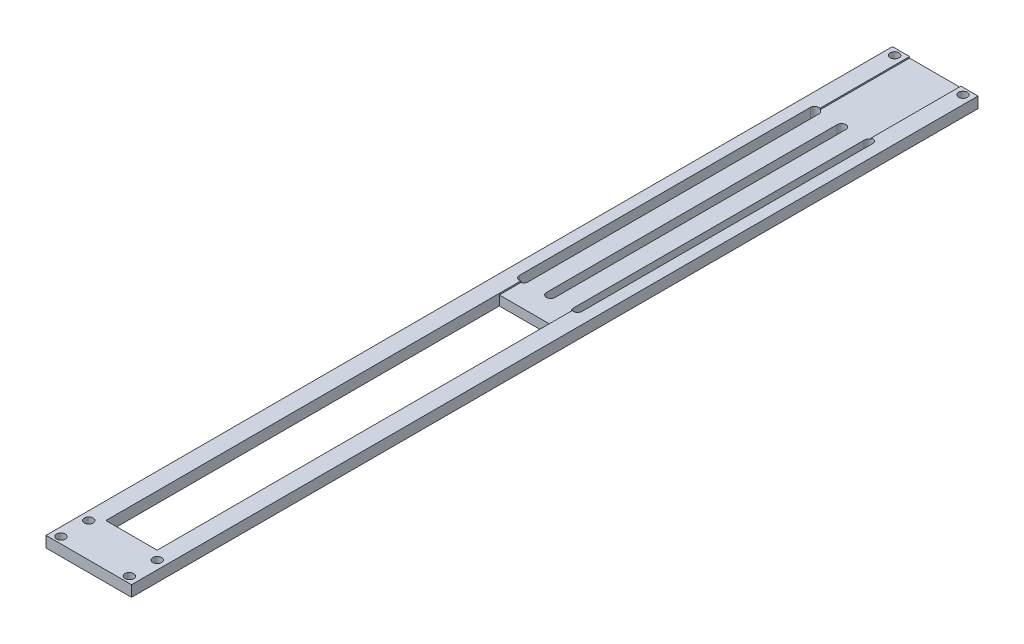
ISO-10303-21;
HEADER;
FILE_DESCRIPTION(('STEP AP214'),'2;1');
FILE_NAME('part.step','',(''),(''),'','','');
FILE_SCHEMA(('AUTOMOTIVE_DESIGN { 1 0 10303 214 1 1 1 1 }'));
ENDSEC;
DATA;
#1=APPLICATION_CONTEXT('core data for automotive mechanical design processes');
#2=APPLICATION_PROTOCOL_DEFINITION('international standard','automotive_design',2000,#1);
#3=PRODUCT_CONTEXT('',#1,'mechanical');
#4=PRODUCT('Part','Part','',(#3));
#5=PRODUCT_RELATED_PRODUCT_CATEGORY('part','',(#4));
#6=PRODUCT_DEFINITION_FORMATION('','',#4);
#7=PRODUCT_DEFINITION_CONTEXT('part definition',#1,'design');
#8=PRODUCT_DEFINITION('design','',#6,#7);
#9=PRODUCT_DEFINITION_SHAPE('','',#8);
#10=(LENGTH_UNIT() NAMED_UNIT(*) SI_UNIT(.MILLI.,.METRE.));
#11=(NAMED_UNIT(*) PLANE_ANGLE_UNIT() SI_UNIT($,.RADIAN.));
#12=(NAMED_UNIT(*) SI_UNIT($,.STERADIAN.) SOLID_ANGLE_UNIT());
#13=UNCERTAINTY_MEASURE_WITH_UNIT(LENGTH_MEASURE(1.E-05),#10,'distance_accuracy_value','');
#14=(GEOMETRIC_REPRESENTATION_CONTEXT(3) GLOBAL_UNCERTAINTY_ASSIGNED_CONTEXT((#13)) GLOBAL_UNIT_ASSIGNED_CONTEXT((#10,
#11,#12)) REPRESENTATION_CONTEXT('',''));
#15=CARTESIAN_POINT('',(0.,0.,0.));
#16=DIRECTION('',(0.,0.,1.));
#17=DIRECTION('',(1.,0.,0.));
#18=AXIS2_PLACEMENT_3D('',#15,#16,#17);
#19=CARTESIAN_POINT('',(9.525,-4.318,152.273));
#20=DIRECTION('',(1.,0.,0.));
#21=DIRECTION('',(0.,0.,-1.));
#22=AXIS2_PLACEMENT_3D('',#19,#20,#21);
#23=PLANE('',#22);
#24=DIRECTION('',(0.,0.,-1.));
#25=VECTOR('',#24,1.);
#26=CARTESIAN_POINT('',(9.525,2.032,152.273));
#27=LINE('',#26,#25);
#28=CARTESIAN_POINT('',(9.52500000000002,2.032,298.323));
#29=VERTEX_POINT('',#28);
#30=CARTESIAN_POINT('',(9.525,2.032,144.27128620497));
#31=VERTEX_POINT('',#30);
#32=EDGE_CURVE('E342',#29,#31,#27,.T.);
#33=ORIENTED_EDGE('',*,*,#32,.T.);
#34=DIRECTION('',(0.,-1.,0.));
#35=VECTOR('',#34,1.);
#36=CARTESIAN_POINT('',(9.525,6.096,144.27128620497));
#37=LINE('',#36,#35);
#38=CARTESIAN_POINT('',(9.525,1.524,144.27128620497));
#39=VERTEX_POINT('',#38);
#40=EDGE_CURVE('E243',#31,#39,#37,.T.);
#41=ORIENTED_EDGE('',*,*,#40,.T.);
#42=DIRECTION('',(0.,0.,-1.));
#43=VECTOR('',#42,1.);
#44=CARTESIAN_POINT('',(9.525,1.524,152.273));
#45=LINE('',#44,#43);
#46=CARTESIAN_POINT('',(9.525,1.524,152.273));
#47=VERTEX_POINT('',#46);
#48=EDGE_CURVE('E322',#47,#39,#45,.T.);
#49=ORIENTED_EDGE('',*,*,#48,.F.);
#50=DIRECTION('',(0.,1.,0.));
#51=VECTOR('',#50,1.);
#52=CARTESIAN_POINT('',(9.525,-4.318,152.273));
#53=LINE('',#52,#51);
#54=CARTESIAN_POINT('',(9.525,-2.032,152.273));
#55=VERTEX_POINT('',#54);
#56=EDGE_CURVE('E350',#55,#47,#53,.T.);
#57=ORIENTED_EDGE('',*,*,#56,.F.);
#58=DIRECTION('',(0.,0.,-1.));
#59=VECTOR('',#58,1.);
#60=CARTESIAN_POINT('',(9.52500000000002,-2.032,314.198));
#61=LINE('',#60,#59);
#62=CARTESIAN_POINT('',(9.52500000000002,-2.032,298.323));
#63=VERTEX_POINT('',#62);
#64=EDGE_CURVE('E391',#63,#55,#61,.T.);
#65=ORIENTED_EDGE('',*,*,#64,.F.);
#66=DIRECTION('',(0.,1.,0.));
#67=VECTOR('',#66,1.);
#68=CARTESIAN_POINT('',(9.52500000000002,-4.318,298.323));
#69=LINE('',#68,#67);
#70=EDGE_CURVE('E353',#63,#29,#69,.T.);
#71=ORIENTED_EDGE('',*,*,#70,.T.);
#72=EDGE_LOOP('',(#33,#41,#49,#57,#65,#71));
#73=FACE_BOUND('',#72,.T.);
#74=ADVANCED_FACE('F35',(#73),#23,.F.);
#75=CARTESIAN_POINT('',(-9.525,-4.318,152.273));
#76=DIRECTION('',(-1.,0.,0.));
#77=DIRECTION('',(0.,0.,1.));
#78=AXIS2_PLACEMENT_3D('',#75,#76,#77);
#79=PLANE('',#78);
#80=DIRECTION('',(0.,0.,1.));
#81=VECTOR('',#80,1.);
#82=CARTESIAN_POINT('',(-9.525,1.524,152.273));
#83=LINE('',#82,#81);
#84=CARTESIAN_POINT('',(-9.525,1.524,144.280295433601));
#85=VERTEX_POINT('',#84);
#86=CARTESIAN_POINT('',(-9.525,1.524,152.273));
#87=VERTEX_POINT('',#86);
#88=EDGE_CURVE('E319',#85,#87,#83,.T.);
#89=ORIENTED_EDGE('',*,*,#88,.F.);
#90=DIRECTION('',(0.,-1.,0.));
#91=VECTOR('',#90,1.);
#92=CARTESIAN_POINT('',(-9.525,6.096,144.280295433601));
#93=LINE('',#92,#91);
#94=CARTESIAN_POINT('',(-9.525,2.032,144.280295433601));
#95=VERTEX_POINT('',#94);
#96=EDGE_CURVE('E278',#85,#95,#93,.F.);
#97=ORIENTED_EDGE('',*,*,#96,.T.);
#98=DIRECTION('',(0.,0.,1.));
#99=VECTOR('',#98,1.);
#100=CARTESIAN_POINT('',(-9.525,2.032,152.273));
#101=LINE('',#100,#99);
#102=CARTESIAN_POINT('',(-9.52499999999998,2.032,298.323));
#103=VERTEX_POINT('',#102);
#104=EDGE_CURVE('E334',#95,#103,#101,.T.);
#105=ORIENTED_EDGE('',*,*,#104,.T.);
#106=DIRECTION('',(0.,1.,0.));
#107=VECTOR('',#106,1.);
#108=CARTESIAN_POINT('',(-9.52499999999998,-4.318,298.323));
#109=LINE('',#108,#107);
#110=CARTESIAN_POINT('',(-9.52499999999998,-2.032,298.323));
#111=VERTEX_POINT('',#110);
#112=EDGE_CURVE('E345',#111,#103,#109,.T.);
#113=ORIENTED_EDGE('',*,*,#112,.F.);
#114=DIRECTION('',(0.,0.,1.));
#115=VECTOR('',#114,1.);
#116=CARTESIAN_POINT('',(-9.52499999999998,-2.032,314.198));
#117=LINE('',#116,#115);
#118=CARTESIAN_POINT('',(-9.525,-2.032,152.273));
#119=VERTEX_POINT('',#118);
#120=EDGE_CURVE('E397',#119,#111,#117,.T.);
#121=ORIENTED_EDGE('',*,*,#120,.F.);
#122=DIRECTION('',(0.,1.,0.));
#123=VECTOR('',#122,1.);
#124=CARTESIAN_POINT('',(-9.525,-4.318,152.273));
#125=LINE('',#124,#123);
#126=EDGE_CURVE('E346',#119,#87,#125,.T.);
#127=ORIENTED_EDGE('',*,*,#126,.T.);
#128=EDGE_LOOP('',(#89,#97,#105,#113,#121,#127));
#129=FACE_BOUND('',#128,.T.);
#130=ADVANCED_FACE('F523',(#129),#79,.F.);
#131=CARTESIAN_POINT('',(15.875,2.032,314.198));
#132=DIRECTION('',(-1.,0.,0.));
#133=DIRECTION('',(0.,0.,1.));
#134=AXIS2_PLACEMENT_3D('',#131,#132,#133);
#135=PLANE('',#134);
#136=DIRECTION('',(0.,1.,0.));
#137=VECTOR('',#136,1.);
#138=CARTESIAN_POINT('',(15.875,2.032,0.));
#139=LINE('',#138,#137);
#140=CARTESIAN_POINT('',(15.875,-2.032,0.));
#141=VERTEX_POINT('',#140);
#142=CARTESIAN_POINT('',(15.875,2.032,0.));
#143=VERTEX_POINT('',#142);
#144=EDGE_CURVE('E349',#141,#143,#139,.T.);
#145=ORIENTED_EDGE('',*,*,#144,.T.);
#146=DIRECTION('',(0.,0.,-1.));
#147=VECTOR('',#146,1.);
#148=CARTESIAN_POINT('',(15.875,2.032,314.198));
#149=LINE('',#148,#147);
#150=CARTESIAN_POINT('',(15.875,2.032,314.198));
#151=VERTEX_POINT('',#150);
#152=EDGE_CURVE('E385',#151,#143,#149,.T.);
#153=ORIENTED_EDGE('',*,*,#152,.F.);
#154=DIRECTION('',(0.,1.,0.));
#155=VECTOR('',#154,1.);
#156=CARTESIAN_POINT('',(15.875,2.032,314.198));
#157=LINE('',#156,#155);
#158=CARTESIAN_POINT('',(15.875,-2.032,314.198));
#159=VERTEX_POINT('',#158);
#160=EDGE_CURVE('E357',#159,#151,#157,.T.);
#161=ORIENTED_EDGE('',*,*,#160,.F.);
#162=DIRECTION('',(0.,0.,-1.));
#163=VECTOR('',#162,1.);
#164=CARTESIAN_POINT('',(15.875,-2.032,314.198));
#165=LINE('',#164,#163);
#166=EDGE_CURVE('E367',#159,#141,#165,.T.);
#167=ORIENTED_EDGE('',*,*,#166,.T.);
#168=EDGE_LOOP('',(#145,#153,#161,#167));
#169=FACE_BOUND('',#168,.T.);
#170=ADVANCED_FACE('F37',(#169),#135,.F.);
#171=CARTESIAN_POINT('',(-15.875,2.032,314.198));
#172=DIRECTION('',(0.,-1.,0.));
#173=DIRECTION('',(0.,0.,-1.));
#174=AXIS2_PLACEMENT_3D('',#171,#172,#173);
#175=PLANE('',#174);
#176=CARTESIAN_POINT('',(12.7,2.032,311.81675));
#177=DIRECTION('',(0.,1.,0.));
#178=DIRECTION('',(0.,0.,1.));
#179=AXIS2_PLACEMENT_3D('',#176,#177,#178);
#180=CIRCLE('',#179,1.63195);
#181=CARTESIAN_POINT('',(12.7,2.032,313.4487));
#182=VERTEX_POINT('',#181);
#183=EDGE_CURVE('E447',#182,#182,#180,.T.);
#184=ORIENTED_EDGE('',*,*,#183,.F.);
#185=EDGE_LOOP('',(#184));
#186=FACE_BOUND('',#185,.T.);
#187=CARTESIAN_POINT('',(-12.7,2.032,311.81675));
#188=DIRECTION('',(0.,1.,0.));
#189=DIRECTION('',(0.,0.,1.));
#190=AXIS2_PLACEMENT_3D('',#187,#188,#189);
#191=CIRCLE('',#190,1.63195);
#192=CARTESIAN_POINT('',(-12.7,2.032,313.4487));
#193=VERTEX_POINT('',#192);
#194=EDGE_CURVE('E437',#193,#193,#191,.T.);
#195=ORIENTED_EDGE('',*,*,#194,.F.);
#196=EDGE_LOOP('',(#195));
#197=FACE_BOUND('',#196,.T.);
#198=CARTESIAN_POINT('',(12.7,2.032,2.38125));
#199=DIRECTION('',(0.,1.,0.));
#200=DIRECTION('',(0.,0.,1.));
#201=AXIS2_PLACEMENT_3D('',#198,#199,#200);
#202=CIRCLE('',#201,1.63195);
#203=CARTESIAN_POINT('',(12.7,2.032,4.0132));
#204=VERTEX_POINT('',#203);
#205=EDGE_CURVE('E434',#204,#204,#202,.T.);
#206=ORIENTED_EDGE('',*,*,#205,.F.);
#207=EDGE_LOOP('',(#206));
#208=FACE_BOUND('',#207,.T.);
#209=CARTESIAN_POINT('',(-12.7,2.032,2.38125));
#210=DIRECTION('',(0.,1.,0.));
#211=DIRECTION('',(0.,0.,1.));
#212=AXIS2_PLACEMENT_3D('',#209,#210,#211);
#213=CIRCLE('',#212,1.63195);
#214=CARTESIAN_POINT('',(-12.7,2.032,4.0132));
#215=VERTEX_POINT('',#214);
#216=EDGE_CURVE('E431',#215,#215,#213,.T.);
#217=ORIENTED_EDGE('',*,*,#216,.F.);
#218=EDGE_LOOP('',(#217));
#219=FACE_BOUND('',#218,.T.);
#220=DIRECTION('',(0.,0.,1.));
#221=VECTOR('',#220,1.);
#222=CARTESIAN_POINT('',(11.6144886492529,2.032,314.198));
#223=LINE('',#222,#221);
#224=CARTESIAN_POINT('',(11.6144886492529,2.032,34.798));
#225=VERTEX_POINT('',#224);
#226=CARTESIAN_POINT('',(11.6144886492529,2.032,142.748));
#227=VERTEX_POINT('',#226);
#228=EDGE_CURVE('E249',#225,#227,#223,.T.);
#229=ORIENTED_EDGE('',*,*,#228,.T.);
#230=CARTESIAN_POINT('',(10.0144886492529,2.032,142.748));
#231=DIRECTION('',(0.,-1.,0.));
#232=DIRECTION('',(0.,0.,-1.));
#233=AXIS2_PLACEMENT_3D('',#230,#231,#232);
#234=CIRCLE('',#233,1.6);
#235=EDGE_CURVE('E246',#227,#31,#234,.T.);
#236=ORIENTED_EDGE('',*,*,#235,.T.);
#237=ORIENTED_EDGE('',*,*,#32,.F.);
#238=DIRECTION('',(1.,0.,0.));
#239=VECTOR('',#238,1.);
#240=CARTESIAN_POINT('',(-9.52499999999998,2.032,298.323));
#241=LINE('',#240,#239);
#242=EDGE_CURVE('E338',#103,#29,#241,.T.);
#243=ORIENTED_EDGE('',*,*,#242,.F.);
#244=ORIENTED_EDGE('',*,*,#104,.F.);
#245=CARTESIAN_POINT('',(-9.98551135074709,2.032,142.748));
#246=DIRECTION('',(0.,-1.,0.));
#247=DIRECTION('',(0.,0.,-1.));
#248=AXIS2_PLACEMENT_3D('',#245,#246,#247);
#249=CIRCLE('',#248,1.6);
#250=CARTESIAN_POINT('',(-11.5855113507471,2.032,142.748));
#251=VERTEX_POINT('',#250);
#252=EDGE_CURVE('E281',#95,#251,#249,.T.);
#253=ORIENTED_EDGE('',*,*,#252,.T.);
#254=DIRECTION('',(0.,0.,-1.));
#255=VECTOR('',#254,1.);
#256=CARTESIAN_POINT('',(-11.5855113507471,2.032,314.198));
#257=LINE('',#256,#255);
#258=CARTESIAN_POINT('',(-11.5855113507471,2.032,34.798));
#259=VERTEX_POINT('',#258);
#260=EDGE_CURVE('E284',#251,#259,#257,.T.);
#261=ORIENTED_EDGE('',*,*,#260,.T.);
#262=CARTESIAN_POINT('',(-9.98551135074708,2.032,34.798));
#263=DIRECTION('',(0.,-1.,0.));
#264=DIRECTION('',(0.,0.,-1.));
#265=AXIS2_PLACEMENT_3D('',#262,#263,#264);
#266=CIRCLE('',#265,1.6);
#267=CARTESIAN_POINT('',(-9.52500000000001,2.032,33.2657045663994));
#268=VERTEX_POINT('',#267);
#269=EDGE_CURVE('E275',#259,#268,#266,.T.);
#270=ORIENTED_EDGE('',*,*,#269,.T.);
#271=CARTESIAN_POINT('',(-9.525,2.032,0.));
#272=VERTEX_POINT('',#271);
#273=EDGE_CURVE('E335',#272,#268,#101,.T.);
#274=ORIENTED_EDGE('',*,*,#273,.F.);
#275=DIRECTION('',(-1.,0.,0.));
#276=VECTOR('',#275,1.);
#277=CARTESIAN_POINT('',(-15.875,2.032,0.));
#278=LINE('',#277,#276);
#279=CARTESIAN_POINT('',(-15.875,2.032,0.));
#280=VERTEX_POINT('',#279);
#281=EDGE_CURVE('E370',#272,#280,#278,.T.);
#282=ORIENTED_EDGE('',*,*,#281,.T.);
#283=DIRECTION('',(0.,0.,-1.));
#284=VECTOR('',#283,1.);
#285=CARTESIAN_POINT('',(-15.875,2.032,314.198));
#286=LINE('',#285,#284);
#287=CARTESIAN_POINT('',(-15.875,2.032,314.198));
#288=VERTEX_POINT('',#287);
#289=EDGE_CURVE('E382',#288,#280,#286,.T.);
#290=ORIENTED_EDGE('',*,*,#289,.F.);
#291=DIRECTION('',(-1.,0.,0.));
#292=VECTOR('',#291,1.);
#293=CARTESIAN_POINT('',(-15.875,2.032,314.198));
#294=LINE('',#293,#292);
#295=EDGE_CURVE('E360',#151,#288,#294,.T.);
#296=ORIENTED_EDGE('',*,*,#295,.F.);
#297=ORIENTED_EDGE('',*,*,#152,.T.);
#298=CARTESIAN_POINT('',(9.525,2.032,0.));
#299=VERTEX_POINT('',#298);
#300=EDGE_CURVE('E371',#143,#299,#278,.T.);
#301=ORIENTED_EDGE('',*,*,#300,.T.);
#302=CARTESIAN_POINT('',(9.52499999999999,2.032,33.2747137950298));
#303=VERTEX_POINT('',#302);
#304=EDGE_CURVE('E341',#303,#299,#27,.T.);
#305=ORIENTED_EDGE('',*,*,#304,.F.);
#306=CARTESIAN_POINT('',(10.0144886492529,2.032,34.798));
#307=DIRECTION('',(0.,-1.,0.));
#308=DIRECTION('',(0.,0.,-1.));
#309=AXIS2_PLACEMENT_3D('',#306,#307,#308);
#310=CIRCLE('',#309,1.6);
#311=EDGE_CURVE('E240',#303,#225,#310,.T.);
#312=ORIENTED_EDGE('',*,*,#311,.T.);
#313=EDGE_LOOP('',(#229,#236,#237,#243,#244,#253,#261,#270,#274,#282,#290,#296,#297,#301,#305,#312));
#314=FACE_BOUND('',#313,.T.);
#315=CARTESIAN_POINT('',(12.7,2.032,301.498));
#316=DIRECTION('',(0.,1.,0.));
#317=DIRECTION('',(0.,0.,1.));
#318=AXIS2_PLACEMENT_3D('',#315,#316,#317);
#319=CIRCLE('',#318,1.63195);
#320=CARTESIAN_POINT('',(12.7,2.032,303.12995));
#321=VERTEX_POINT('',#320);
#322=EDGE_CURVE('E301',#321,#321,#319,.T.);
#323=ORIENTED_EDGE('',*,*,#322,.F.);
#324=EDGE_LOOP('',(#323));
#325=FACE_BOUND('',#324,.T.);
#326=CARTESIAN_POINT('',(-12.7,2.032,301.498));
#327=DIRECTION('',(0.,1.,0.));
#328=DIRECTION('',(0.,0.,1.));
#329=AXIS2_PLACEMENT_3D('',#326,#327,#328);
#330=CIRCLE('',#329,1.63195);
#331=CARTESIAN_POINT('',(-12.7,2.032,303.12995));
#332=VERTEX_POINT('',#331);
#333=EDGE_CURVE('E311',#332,#332,#330,.T.);
#334=ORIENTED_EDGE('',*,*,#333,.F.);
#335=EDGE_LOOP('',(#334));
#336=FACE_BOUND('',#335,.T.);
#337=ADVANCED_FACE('F456',(#186,#197,#208,#219,#314,#325,#336),#175,.F.);
#338=CARTESIAN_POINT('',(-15.875,2.032,314.198));
#339=DIRECTION('',(1.,0.,0.));
#340=DIRECTION('',(0.,0.,-1.));
#341=AXIS2_PLACEMENT_3D('',#338,#339,#340);
#342=PLANE('',#341);
#343=DIRECTION('',(0.,-1.,0.));
#344=VECTOR('',#343,1.);
#345=CARTESIAN_POINT('',(-15.875,2.032,0.));
#346=LINE('',#345,#344);
#347=CARTESIAN_POINT('',(-15.875,-2.032,0.));
#348=VERTEX_POINT('',#347);
#349=EDGE_CURVE('E374',#280,#348,#346,.T.);
#350=ORIENTED_EDGE('',*,*,#349,.T.);
#351=DIRECTION('',(0.,0.,-1.));
#352=VECTOR('',#351,1.);
#353=CARTESIAN_POINT('',(-15.875,-2.032,314.198));
#354=LINE('',#353,#352);
#355=CARTESIAN_POINT('',(-15.875,-2.032,314.198));
#356=VERTEX_POINT('',#355);
#357=EDGE_CURVE('E379',#356,#348,#354,.T.);
#358=ORIENTED_EDGE('',*,*,#357,.F.);
#359=DIRECTION('',(0.,-1.,0.));
#360=VECTOR('',#359,1.);
#361=CARTESIAN_POINT('',(-15.875,2.032,314.198));
#362=LINE('',#361,#360);
#363=EDGE_CURVE('E363',#288,#356,#362,.T.);
#364=ORIENTED_EDGE('',*,*,#363,.F.);
#365=ORIENTED_EDGE('',*,*,#289,.T.);
#366=EDGE_LOOP('',(#350,#358,#364,#365));
#367=FACE_BOUND('',#366,.T.);
#368=ADVANCED_FACE('F459',(#367),#342,.F.);
#369=CARTESIAN_POINT('',(-15.875,-2.032,314.198));
#370=DIRECTION('',(0.,1.,0.));
#371=DIRECTION('',(0.,0.,1.));
#372=AXIS2_PLACEMENT_3D('',#369,#370,#371);
#373=PLANE('',#372);
#374=CARTESIAN_POINT('',(12.7,-2.032,311.81675));
#375=DIRECTION('',(0.,1.,0.));
#376=DIRECTION('',(0.,0.,1.));
#377=AXIS2_PLACEMENT_3D('',#374,#375,#376);
#378=CIRCLE('',#377,1.63194999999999);
#379=CARTESIAN_POINT('',(12.7,-2.032,313.4487));
#380=VERTEX_POINT('',#379);
#381=EDGE_CURVE('E39',#380,#380,#378,.T.);
#382=ORIENTED_EDGE('',*,*,#381,.T.);
#383=EDGE_LOOP('',(#382));
#384=FACE_BOUND('',#383,.T.);
#385=CARTESIAN_POINT('',(-12.7,-2.032,311.81675));
#386=DIRECTION('',(0.,1.,0.));
#387=DIRECTION('',(0.,0.,1.));
#388=AXIS2_PLACEMENT_3D('',#385,#386,#387);
#389=CIRCLE('',#388,1.63194999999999);
#390=CARTESIAN_POINT('',(-12.7,-2.032,313.4487));
#391=VERTEX_POINT('',#390);
#392=EDGE_CURVE('E435',#391,#391,#389,.T.);
#393=ORIENTED_EDGE('',*,*,#392,.T.);
#394=EDGE_LOOP('',(#393));
#395=FACE_BOUND('',#394,.T.);
#396=CARTESIAN_POINT('',(12.7,-2.032,2.38125));
#397=DIRECTION('',(0.,1.,0.));
#398=DIRECTION('',(0.,0.,1.));
#399=AXIS2_PLACEMENT_3D('',#396,#397,#398);
#400=CIRCLE('',#399,1.63194999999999);
#401=CARTESIAN_POINT('',(12.7,-2.032,4.01319999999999));
#402=VERTEX_POINT('',#401);
#403=EDGE_CURVE('E432',#402,#402,#400,.T.);
#404=ORIENTED_EDGE('',*,*,#403,.T.);
#405=EDGE_LOOP('',(#404));
#406=FACE_BOUND('',#405,.T.);
#407=CARTESIAN_POINT('',(-12.7,-2.032,2.38125));
#408=DIRECTION('',(0.,1.,0.));
#409=DIRECTION('',(0.,0.,1.));
#410=AXIS2_PLACEMENT_3D('',#407,#408,#409);
#411=CIRCLE('',#410,1.63194999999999);
#412=CARTESIAN_POINT('',(-12.7,-2.032,4.01319999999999));
#413=VERTEX_POINT('',#412);
#414=EDGE_CURVE('E428',#413,#413,#411,.T.);
#415=ORIENTED_EDGE('',*,*,#414,.T.);
#416=EDGE_LOOP('',(#415));
#417=FACE_BOUND('',#416,.T.);
#418=DIRECTION('',(0.,0.,-1.));
#419=VECTOR('',#418,1.);
#420=CARTESIAN_POINT('',(8.41448864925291,-2.032,142.748));
#421=LINE('',#420,#419);
#422=CARTESIAN_POINT('',(8.41448864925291,-2.032,142.748));
#423=VERTEX_POINT('',#422);
#424=CARTESIAN_POINT('',(8.41448864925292,-2.032,34.798));
#425=VERTEX_POINT('',#424);
#426=EDGE_CURVE('E221',#423,#425,#421,.T.);
#427=ORIENTED_EDGE('',*,*,#426,.F.);
#428=CARTESIAN_POINT('',(10.0144886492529,-2.032,142.748));
#429=DIRECTION('',(0.,-1.,0.));
#430=DIRECTION('',(0.,0.,-1.));
#431=AXIS2_PLACEMENT_3D('',#428,#429,#430);
#432=CIRCLE('',#431,1.6);
#433=CARTESIAN_POINT('',(11.6144886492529,-2.032,142.748));
#434=VERTEX_POINT('',#433);
#435=EDGE_CURVE('E52',#434,#423,#432,.T.);
#436=ORIENTED_EDGE('',*,*,#435,.F.);
#437=DIRECTION('',(0.,0.,1.));
#438=VECTOR('',#437,1.);
#439=CARTESIAN_POINT('',(11.6144886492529,-2.032,142.748));
#440=LINE('',#439,#438);
#441=CARTESIAN_POINT('',(11.6144886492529,-2.032,34.798));
#442=VERTEX_POINT('',#441);
#443=EDGE_CURVE('E228',#442,#434,#440,.T.);
#444=ORIENTED_EDGE('',*,*,#443,.F.);
#445=CARTESIAN_POINT('',(10.0144886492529,-2.032,34.798));
#446=DIRECTION('',(0.,-1.,0.));
#447=DIRECTION('',(0.,0.,-1.));
#448=AXIS2_PLACEMENT_3D('',#445,#446,#447);
#449=CIRCLE('',#448,1.6);
#450=EDGE_CURVE('E213',#425,#442,#449,.T.);
#451=ORIENTED_EDGE('',*,*,#450,.F.);
#452=EDGE_LOOP('',(#427,#436,#444,#451));
#453=FACE_BOUND('',#452,.T.);
#454=DIRECTION('',(0.,0.,-1.));
#455=VECTOR('',#454,1.);
#456=CARTESIAN_POINT('',(-11.5855113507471,-2.032,142.748));
#457=LINE('',#456,#455);
#458=CARTESIAN_POINT('',(-11.5855113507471,-2.032,142.748));
#459=VERTEX_POINT('',#458);
#460=CARTESIAN_POINT('',(-11.5855113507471,-2.032,34.798));
#461=VERTEX_POINT('',#460);
#462=EDGE_CURVE('E254',#459,#461,#457,.T.);
#463=ORIENTED_EDGE('',*,*,#462,.F.);
#464=CARTESIAN_POINT('',(-9.98551135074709,-2.032,142.748));
#465=DIRECTION('',(0.,-1.,0.));
#466=DIRECTION('',(0.,0.,-1.));
#467=AXIS2_PLACEMENT_3D('',#464,#465,#466);
#468=CIRCLE('',#467,1.6);
#469=CARTESIAN_POINT('',(-8.38551135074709,-2.032,142.748));
#470=VERTEX_POINT('',#469);
#471=EDGE_CURVE('E252',#470,#459,#468,.T.);
#472=ORIENTED_EDGE('',*,*,#471,.F.);
#473=DIRECTION('',(0.,0.,1.));
#474=VECTOR('',#473,1.);
#475=CARTESIAN_POINT('',(-8.38551135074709,-2.032,142.748));
#476=LINE('',#475,#474);
#477=CARTESIAN_POINT('',(-8.38551135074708,-2.032,34.798));
#478=VERTEX_POINT('',#477);
#479=EDGE_CURVE('E260',#478,#470,#476,.T.);
#480=ORIENTED_EDGE('',*,*,#479,.F.);
#481=CARTESIAN_POINT('',(-9.98551135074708,-2.032,34.798));
#482=DIRECTION('',(0.,-1.,0.));
#483=DIRECTION('',(0.,0.,-1.));
#484=AXIS2_PLACEMENT_3D('',#481,#482,#483);
#485=CIRCLE('',#484,1.6);
#486=EDGE_CURVE('E257',#461,#478,#485,.T.);
#487=ORIENTED_EDGE('',*,*,#486,.F.);
#488=EDGE_LOOP('',(#463,#472,#480,#487));
#489=FACE_BOUND('',#488,.T.);
#490=DIRECTION('',(0.,0.,-1.));
#491=VECTOR('',#490,1.);
#492=CARTESIAN_POINT('',(-1.58551135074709,-2.032,142.748));
#493=LINE('',#492,#491);
#494=CARTESIAN_POINT('',(-1.58551135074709,-2.032,142.748));
#495=VERTEX_POINT('',#494);
#496=CARTESIAN_POINT('',(-1.58551135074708,-2.032,34.798));
#497=VERTEX_POINT('',#496);
#498=EDGE_CURVE('E289',#495,#497,#493,.T.);
#499=ORIENTED_EDGE('',*,*,#498,.F.);
#500=CARTESIAN_POINT('',(0.0144886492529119,-2.032,142.748));
#501=DIRECTION('',(0.,-1.,0.));
#502=DIRECTION('',(0.,0.,-1.));
#503=AXIS2_PLACEMENT_3D('',#500,#501,#502);
#504=CIRCLE('',#503,1.6);
#505=CARTESIAN_POINT('',(1.61448864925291,-2.032,142.748));
#506=VERTEX_POINT('',#505);
#507=EDGE_CURVE('E287',#506,#495,#504,.T.);
#508=ORIENTED_EDGE('',*,*,#507,.F.);
#509=DIRECTION('',(0.,0.,1.));
#510=VECTOR('',#509,1.);
#511=CARTESIAN_POINT('',(1.61448864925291,-2.032,142.748));
#512=LINE('',#511,#510);
#513=CARTESIAN_POINT('',(1.61448864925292,-2.032,34.798));
#514=VERTEX_POINT('',#513);
#515=EDGE_CURVE('E295',#514,#506,#512,.T.);
#516=ORIENTED_EDGE('',*,*,#515,.F.);
#517=CARTESIAN_POINT('',(0.0144886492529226,-2.032,34.798));
#518=DIRECTION('',(0.,-1.,0.));
#519=DIRECTION('',(0.,0.,-1.));
#520=AXIS2_PLACEMENT_3D('',#517,#518,#519);
#521=CIRCLE('',#520,1.6);
#522=EDGE_CURVE('E292',#497,#514,#521,.T.);
#523=ORIENTED_EDGE('',*,*,#522,.F.);
#524=EDGE_LOOP('',(#499,#508,#516,#523));
#525=FACE_BOUND('',#524,.T.);
#526=CARTESIAN_POINT('',(12.7,-2.032,301.498));
#527=DIRECTION('',(0.,1.,0.));
#528=DIRECTION('',(0.,0.,1.));
#529=AXIS2_PLACEMENT_3D('',#526,#527,#528);
#530=CIRCLE('',#529,1.63194999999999);
#531=CARTESIAN_POINT('',(12.7,-2.032,303.12995));
#532=VERTEX_POINT('',#531);
#533=EDGE_CURVE('E310',#532,#532,#530,.T.);
#534=ORIENTED_EDGE('',*,*,#533,.T.);
#535=EDGE_LOOP('',(#534));
#536=FACE_BOUND('',#535,.T.);
#537=CARTESIAN_POINT('',(-12.7,-2.032,301.498));
#538=DIRECTION('',(0.,1.,0.));
#539=DIRECTION('',(0.,0.,1.));
#540=AXIS2_PLACEMENT_3D('',#537,#538,#539);
#541=CIRCLE('',#540,1.63194999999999);
#542=CARTESIAN_POINT('',(-12.7,-2.032,303.12995));
#543=VERTEX_POINT('',#542);
#544=EDGE_CURVE('E314',#543,#543,#541,.T.);
#545=ORIENTED_EDGE('',*,*,#544,.T.);
#546=EDGE_LOOP('',(#545));
#547=FACE_BOUND('',#546,.T.);
#548=DIRECTION('',(-1.,0.,0.));
#549=VECTOR('',#548,1.);
#550=CARTESIAN_POINT('',(-15.875,-2.032,152.273));
#551=LINE('',#550,#549);
#552=EDGE_CURVE('E394',#55,#119,#551,.T.);
#553=ORIENTED_EDGE('',*,*,#552,.T.);
#554=ORIENTED_EDGE('',*,*,#120,.T.);
#555=DIRECTION('',(1.,0.,0.));
#556=VECTOR('',#555,1.);
#557=CARTESIAN_POINT('',(-15.875,-2.032,298.323));
#558=LINE('',#557,#556);
#559=EDGE_CURVE('E388',#111,#63,#558,.T.);
#560=ORIENTED_EDGE('',*,*,#559,.T.);
#561=ORIENTED_EDGE('',*,*,#64,.T.);
#562=EDGE_LOOP('',(#553,#554,#560,#561));
#563=FACE_BOUND('',#562,.T.);
#564=DIRECTION('',(1.,0.,0.));
#565=VECTOR('',#564,1.);
#566=CARTESIAN_POINT('',(-15.875,-2.032,0.));
#567=LINE('',#566,#565);
#568=EDGE_CURVE('E361',#348,#141,#567,.T.);
#569=ORIENTED_EDGE('',*,*,#568,.T.);
#570=ORIENTED_EDGE('',*,*,#166,.F.);
#571=DIRECTION('',(1.,0.,0.));
#572=VECTOR('',#571,1.);
#573=CARTESIAN_POINT('',(-15.875,-2.032,314.198));
#574=LINE('',#573,#572);
#575=EDGE_CURVE('E365',#356,#159,#574,.T.);
#576=ORIENTED_EDGE('',*,*,#575,.F.);
#577=ORIENTED_EDGE('',*,*,#357,.T.);
#578=EDGE_LOOP('',(#569,#570,#576,#577));
#579=FACE_BOUND('',#578,.T.);
#580=ADVANCED_FACE('F225',(#384,#395,#406,#417,#453,#489,#525,#536,#547,#563,#579),#373,.F.);
#581=CARTESIAN_POINT('',(0.,0.,314.198));
#582=DIRECTION('',(0.,0.,1.));
#583=DIRECTION('',(1.,0.,0.));
#584=AXIS2_PLACEMENT_3D('',#581,#582,#583);
#585=PLANE('',#584);
#586=ORIENTED_EDGE('',*,*,#160,.T.);
#587=ORIENTED_EDGE('',*,*,#295,.T.);
#588=ORIENTED_EDGE('',*,*,#363,.T.);
#589=ORIENTED_EDGE('',*,*,#575,.T.);
#590=EDGE_LOOP('',(#586,#587,#588,#589));
#591=FACE_BOUND('',#590,.T.);
#592=ADVANCED_FACE('F476',(#591),#585,.T.);
#593=CARTESIAN_POINT('',(0.,0.,0.));
#594=DIRECTION('',(0.,0.,1.));
#595=DIRECTION('',(1.,0.,0.));
#596=AXIS2_PLACEMENT_3D('',#593,#594,#595);
#597=PLANE('',#596);
#598=ORIENTED_EDGE('',*,*,#281,.F.);
#599=DIRECTION('',(0.,-1.,0.));
#600=VECTOR('',#599,1.);
#601=CARTESIAN_POINT('',(-9.525,0.,0.));
#602=LINE('',#601,#600);
#603=CARTESIAN_POINT('',(-9.525,1.524,0.));
#604=VERTEX_POINT('',#603);
#605=EDGE_CURVE('E331',#272,#604,#602,.T.);
#606=ORIENTED_EDGE('',*,*,#605,.T.);
#607=DIRECTION('',(1.,0.,0.));
#608=VECTOR('',#607,1.);
#609=CARTESIAN_POINT('',(0.,1.524,0.));
#610=LINE('',#609,#608);
#611=CARTESIAN_POINT('',(9.525,1.524,0.));
#612=VERTEX_POINT('',#611);
#613=EDGE_CURVE('E325',#604,#612,#610,.T.);
#614=ORIENTED_EDGE('',*,*,#613,.T.);
#615=DIRECTION('',(0.,1.,0.));
#616=VECTOR('',#615,1.);
#617=CARTESIAN_POINT('',(9.525,0.,0.));
#618=LINE('',#617,#616);
#619=EDGE_CURVE('E328',#612,#299,#618,.T.);
#620=ORIENTED_EDGE('',*,*,#619,.T.);
#621=ORIENTED_EDGE('',*,*,#300,.F.);
#622=ORIENTED_EDGE('',*,*,#144,.F.);
#623=ORIENTED_EDGE('',*,*,#568,.F.);
#624=ORIENTED_EDGE('',*,*,#349,.F.);
#625=EDGE_LOOP('',(#598,#606,#614,#620,#621,#622,#623,#624));
#626=FACE_BOUND('',#625,.T.);
#627=ADVANCED_FACE('F491',(#626),#597,.F.);
#628=ORIENTED_EDGE('',*,*,#273,.T.);
#629=DIRECTION('',(0.,-1.,0.));
#630=VECTOR('',#629,1.);
#631=CARTESIAN_POINT('',(-9.52500000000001,6.096,33.2657045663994));
#632=LINE('',#631,#630);
#633=CARTESIAN_POINT('',(-9.525,1.524,33.2657045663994));
#634=VERTEX_POINT('',#633);
#635=EDGE_CURVE('E266',#268,#634,#632,.T.);
#636=ORIENTED_EDGE('',*,*,#635,.T.);
#637=EDGE_CURVE('E315',#604,#634,#83,.T.);
#638=ORIENTED_EDGE('',*,*,#637,.F.);
#639=ORIENTED_EDGE('',*,*,#605,.F.);
#640=EDGE_LOOP('',(#628,#636,#638,#639));
#641=FACE_BOUND('',#640,.T.);
#642=ADVANCED_FACE('F501',(#641),#79,.F.);
#643=CARTESIAN_POINT('',(-9.525,-4.318,152.273));
#644=DIRECTION('',(0.,0.,-1.));
#645=DIRECTION('',(-1.,0.,0.));
#646=AXIS2_PLACEMENT_3D('',#643,#644,#645);
#647=PLANE('',#646);
#648=ORIENTED_EDGE('',*,*,#56,.T.);
#649=DIRECTION('',(1.,0.,0.));
#650=VECTOR('',#649,1.);
#651=CARTESIAN_POINT('',(-9.525,1.524,152.273));
#652=LINE('',#651,#650);
#653=EDGE_CURVE('E318',#87,#47,#652,.T.);
#654=ORIENTED_EDGE('',*,*,#653,.F.);
#655=ORIENTED_EDGE('',*,*,#126,.F.);
#656=ORIENTED_EDGE('',*,*,#552,.F.);
#657=EDGE_LOOP('',(#648,#654,#655,#656));
#658=FACE_BOUND('',#657,.T.);
#659=ADVANCED_FACE('F560',(#658),#647,.F.);
#660=CARTESIAN_POINT('',(9.525,1.524,33.2747137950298));
#661=VERTEX_POINT('',#660);
#662=EDGE_CURVE('E321',#661,#612,#45,.T.);
#663=ORIENTED_EDGE('',*,*,#662,.F.);
#664=DIRECTION('',(0.,-1.,0.));
#665=VECTOR('',#664,1.);
#666=CARTESIAN_POINT('',(9.52499999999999,6.096,33.2747137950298));
#667=LINE('',#666,#665);
#668=EDGE_CURVE('E235',#661,#303,#667,.F.);
#669=ORIENTED_EDGE('',*,*,#668,.T.);
#670=ORIENTED_EDGE('',*,*,#304,.T.);
#671=ORIENTED_EDGE('',*,*,#619,.F.);
#672=EDGE_LOOP('',(#663,#669,#670,#671));
#673=FACE_BOUND('',#672,.T.);
#674=ADVANCED_FACE('F506',(#673),#23,.F.);
#675=CARTESIAN_POINT('',(-9.52499999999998,-4.318,298.323));
#676=DIRECTION('',(0.,0.,1.));
#677=DIRECTION('',(1.,0.,0.));
#678=AXIS2_PLACEMENT_3D('',#675,#676,#677);
#679=PLANE('',#678);
#680=ORIENTED_EDGE('',*,*,#112,.T.);
#681=ORIENTED_EDGE('',*,*,#242,.T.);
#682=ORIENTED_EDGE('',*,*,#70,.F.);
#683=ORIENTED_EDGE('',*,*,#559,.F.);
#684=EDGE_LOOP('',(#680,#681,#682,#683));
#685=FACE_BOUND('',#684,.T.);
#686=ADVANCED_FACE('F518',(#685),#679,.F.);
#687=CARTESIAN_POINT('',(0.,1.524,0.));
#688=DIRECTION('',(0.,-1.,0.));
#689=DIRECTION('',(0.,0.,-1.));
#690=AXIS2_PLACEMENT_3D('',#687,#688,#689);
#691=PLANE('',#690);
#692=ORIENTED_EDGE('',*,*,#48,.T.);
#693=CARTESIAN_POINT('',(10.0144886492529,1.524,142.748));
#694=DIRECTION('',(0.,-1.,0.));
#695=DIRECTION('',(0.,0.,-1.));
#696=AXIS2_PLACEMENT_3D('',#693,#694,#695);
#697=CIRCLE('',#696,1.6);
#698=CARTESIAN_POINT('',(8.41448864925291,1.524,142.748));
#699=VERTEX_POINT('',#698);
#700=EDGE_CURVE('E11',#39,#699,#697,.T.);
#701=ORIENTED_EDGE('',*,*,#700,.T.);
#702=DIRECTION('',(0.,0.,-1.));
#703=VECTOR('',#702,1.);
#704=CARTESIAN_POINT('',(8.41448864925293,1.524,0.));
#705=LINE('',#704,#703);
#706=CARTESIAN_POINT('',(8.41448864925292,1.524,34.798));
#707=VERTEX_POINT('',#706);
#708=EDGE_CURVE('E425',#699,#707,#705,.T.);
#709=ORIENTED_EDGE('',*,*,#708,.T.);
#710=CARTESIAN_POINT('',(10.0144886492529,1.524,34.798));
#711=DIRECTION('',(0.,-1.,0.));
#712=DIRECTION('',(0.,0.,-1.));
#713=AXIS2_PLACEMENT_3D('',#710,#711,#712);
#714=CIRCLE('',#713,1.6);
#715=EDGE_CURVE('E44',#707,#661,#714,.T.);
#716=ORIENTED_EDGE('',*,*,#715,.T.);
#717=ORIENTED_EDGE('',*,*,#662,.T.);
#718=ORIENTED_EDGE('',*,*,#613,.F.);
#719=ORIENTED_EDGE('',*,*,#637,.T.);
#720=CARTESIAN_POINT('',(-9.98551135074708,1.524,34.798));
#721=DIRECTION('',(0.,-1.,0.));
#722=DIRECTION('',(0.,0.,-1.));
#723=AXIS2_PLACEMENT_3D('',#720,#721,#722);
#724=CIRCLE('',#723,1.6);
#725=CARTESIAN_POINT('',(-8.38551135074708,1.524,34.798));
#726=VERTEX_POINT('',#725);
#727=EDGE_CURVE('E416',#634,#726,#724,.T.);
#728=ORIENTED_EDGE('',*,*,#727,.T.);
#729=DIRECTION('',(0.,0.,1.));
#730=VECTOR('',#729,1.);
#731=CARTESIAN_POINT('',(-8.38551135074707,1.524,0.));
#732=LINE('',#731,#730);
#733=CARTESIAN_POINT('',(-8.38551135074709,1.524,142.748));
#734=VERTEX_POINT('',#733);
#735=EDGE_CURVE('E419',#726,#734,#732,.T.);
#736=ORIENTED_EDGE('',*,*,#735,.T.);
#737=CARTESIAN_POINT('',(-9.98551135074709,1.524,142.748));
#738=DIRECTION('',(0.,-1.,0.));
#739=DIRECTION('',(0.,0.,-1.));
#740=AXIS2_PLACEMENT_3D('',#737,#738,#739);
#741=CIRCLE('',#740,1.6);
#742=EDGE_CURVE('E422',#734,#85,#741,.T.);
#743=ORIENTED_EDGE('',*,*,#742,.T.);
#744=ORIENTED_EDGE('',*,*,#88,.T.);
#745=ORIENTED_EDGE('',*,*,#653,.T.);
#746=EDGE_LOOP('',(#692,#701,#709,#716,#717,#718,#719,#728,#736,#743,#744,#745));
#747=FACE_BOUND('',#746,.T.);
#748=DIRECTION('',(0.,0.,1.));
#749=VECTOR('',#748,1.);
#750=CARTESIAN_POINT('',(1.61448864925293,1.524,0.));
#751=LINE('',#750,#749);
#752=CARTESIAN_POINT('',(1.61448864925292,1.524,34.798));
#753=VERTEX_POINT('',#752);
#754=CARTESIAN_POINT('',(1.61448864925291,1.524,142.748));
#755=VERTEX_POINT('',#754);
#756=EDGE_CURVE('E410',#753,#755,#751,.T.);
#757=ORIENTED_EDGE('',*,*,#756,.T.);
#758=CARTESIAN_POINT('',(0.0144886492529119,1.524,142.748));
#759=DIRECTION('',(0.,-1.,0.));
#760=DIRECTION('',(0.,0.,-1.));
#761=AXIS2_PLACEMENT_3D('',#758,#759,#760);
#762=CIRCLE('',#761,1.6);
#763=CARTESIAN_POINT('',(-1.58551135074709,1.524,142.748));
#764=VERTEX_POINT('',#763);
#765=EDGE_CURVE('E413',#755,#764,#762,.T.);
#766=ORIENTED_EDGE('',*,*,#765,.T.);
#767=DIRECTION('',(0.,0.,-1.));
#768=VECTOR('',#767,1.);
#769=CARTESIAN_POINT('',(-1.58551135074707,1.524,0.));
#770=LINE('',#769,#768);
#771=CARTESIAN_POINT('',(-1.58551135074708,1.524,34.798));
#772=VERTEX_POINT('',#771);
#773=EDGE_CURVE('E400',#764,#772,#770,.T.);
#774=ORIENTED_EDGE('',*,*,#773,.T.);
#775=CARTESIAN_POINT('',(0.0144886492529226,1.524,34.798));
#776=DIRECTION('',(0.,-1.,0.));
#777=DIRECTION('',(0.,0.,-1.));
#778=AXIS2_PLACEMENT_3D('',#775,#776,#777);
#779=CIRCLE('',#778,1.6);
#780=EDGE_CURVE('E407',#772,#753,#779,.T.);
#781=ORIENTED_EDGE('',*,*,#780,.T.);
#782=EDGE_LOOP('',(#757,#766,#774,#781));
#783=FACE_BOUND('',#782,.T.);
#784=ADVANCED_FACE('F470',(#747,#783),#691,.F.);
#785=CARTESIAN_POINT('',(-12.7,2.032,301.498));
#786=DIRECTION('',(0.,1.,0.));
#787=DIRECTION('',(0.,0.,1.));
#788=AXIS2_PLACEMENT_3D('',#785,#786,#787);
#789=CYLINDRICAL_SURFACE('',#788,1.63194999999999);
#790=ORIENTED_EDGE('',*,*,#333,.T.);
#791=EDGE_LOOP('',(#790));
#792=FACE_BOUND('',#791,.T.);
#793=ORIENTED_EDGE('',*,*,#544,.F.);
#794=EDGE_LOOP('',(#793));
#795=FACE_BOUND('',#794,.T.);
#796=ADVANCED_FACE('F466',(#792,#795),#789,.F.);
#797=CARTESIAN_POINT('',(12.7,2.032,301.498));
#798=DIRECTION('',(0.,1.,0.));
#799=DIRECTION('',(0.,0.,1.));
#800=AXIS2_PLACEMENT_3D('',#797,#798,#799);
#801=CYLINDRICAL_SURFACE('',#800,1.63194999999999);
#802=ORIENTED_EDGE('',*,*,#322,.T.);
#803=EDGE_LOOP('',(#802));
#804=FACE_BOUND('',#803,.T.);
#805=ORIENTED_EDGE('',*,*,#533,.F.);
#806=EDGE_LOOP('',(#805));
#807=FACE_BOUND('',#806,.T.);
#808=ADVANCED_FACE('F469',(#804,#807),#801,.F.);
#809=CARTESIAN_POINT('',(0.0144886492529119,6.096,142.748));
#810=DIRECTION('',(0.,-1.,0.));
#811=DIRECTION('',(0.,0.,-1.));
#812=AXIS2_PLACEMENT_3D('',#809,#810,#811);
#813=CYLINDRICAL_SURFACE('',#812,1.6);
#814=DIRECTION('',(0.,-1.,0.));
#815=VECTOR('',#814,1.);
#816=CARTESIAN_POINT('',(1.61448864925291,6.096,142.748));
#817=LINE('',#816,#815);
#818=EDGE_CURVE('E299',#755,#506,#817,.T.);
#819=ORIENTED_EDGE('',*,*,#818,.T.);
#820=ORIENTED_EDGE('',*,*,#507,.T.);
#821=DIRECTION('',(0.,-1.,0.));
#822=VECTOR('',#821,1.);
#823=CARTESIAN_POINT('',(-1.58551135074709,6.096,142.748));
#824=LINE('',#823,#822);
#825=EDGE_CURVE('E298',#764,#495,#824,.T.);
#826=ORIENTED_EDGE('',*,*,#825,.F.);
#827=ORIENTED_EDGE('',*,*,#765,.F.);
#828=EDGE_LOOP('',(#819,#820,#826,#827));
#829=FACE_BOUND('',#828,.T.);
#830=ADVANCED_FACE('F574',(#829),#813,.F.);
#831=CARTESIAN_POINT('',(1.61448864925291,6.096,142.748));
#832=DIRECTION('',(1.,0.,0.));
#833=DIRECTION('',(0.,0.,-1.));
#834=AXIS2_PLACEMENT_3D('',#831,#832,#833);
#835=PLANE('',#834);
#836=DIRECTION('',(0.,-1.,0.));
#837=VECTOR('',#836,1.);
#838=CARTESIAN_POINT('',(1.61448864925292,6.096,34.798));
#839=LINE('',#838,#837);
#840=EDGE_CURVE('E302',#753,#514,#839,.T.);
#841=ORIENTED_EDGE('',*,*,#840,.T.);
#842=ORIENTED_EDGE('',*,*,#515,.T.);
#843=ORIENTED_EDGE('',*,*,#818,.F.);
#844=ORIENTED_EDGE('',*,*,#756,.F.);
#845=EDGE_LOOP('',(#841,#842,#843,#844));
#846=FACE_BOUND('',#845,.T.);
#847=ADVANCED_FACE('F578',(#846),#835,.F.);
#848=CARTESIAN_POINT('',(0.0144886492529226,6.096,34.798));
#849=DIRECTION('',(0.,-1.,0.));
#850=DIRECTION('',(0.,0.,-1.));
#851=AXIS2_PLACEMENT_3D('',#848,#849,#850);
#852=CYLINDRICAL_SURFACE('',#851,1.6);
#853=DIRECTION('',(0.,-1.,0.));
#854=VECTOR('',#853,1.);
#855=CARTESIAN_POINT('',(-1.58551135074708,6.096,34.798));
#856=LINE('',#855,#854);
#857=EDGE_CURVE('E304',#772,#497,#856,.T.);
#858=ORIENTED_EDGE('',*,*,#857,.T.);
#859=ORIENTED_EDGE('',*,*,#522,.T.);
#860=ORIENTED_EDGE('',*,*,#840,.F.);
#861=ORIENTED_EDGE('',*,*,#780,.F.);
#862=EDGE_LOOP('',(#858,#859,#860,#861));
#863=FACE_BOUND('',#862,.T.);
#864=ADVANCED_FACE('F583',(#863),#852,.F.);
#865=CARTESIAN_POINT('',(-1.58551135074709,6.096,142.748));
#866=DIRECTION('',(-1.,0.,0.));
#867=DIRECTION('',(0.,0.,1.));
#868=AXIS2_PLACEMENT_3D('',#865,#866,#867);
#869=PLANE('',#868);
#870=ORIENTED_EDGE('',*,*,#825,.T.);
#871=ORIENTED_EDGE('',*,*,#498,.T.);
#872=ORIENTED_EDGE('',*,*,#857,.F.);
#873=ORIENTED_EDGE('',*,*,#773,.F.);
#874=EDGE_LOOP('',(#870,#871,#872,#873));
#875=FACE_BOUND('',#874,.T.);
#876=ADVANCED_FACE('F580',(#875),#869,.F.);
#877=CARTESIAN_POINT('',(-11.5855113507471,6.096,142.748));
#878=DIRECTION('',(-1.,0.,0.));
#879=DIRECTION('',(0.,0.,1.));
#880=AXIS2_PLACEMENT_3D('',#877,#878,#879);
#881=PLANE('',#880);
#882=DIRECTION('',(0.,-1.,0.));
#883=VECTOR('',#882,1.);
#884=CARTESIAN_POINT('',(-11.5855113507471,6.096,142.748));
#885=LINE('',#884,#883);
#886=EDGE_CURVE('E263',#251,#459,#885,.T.);
#887=ORIENTED_EDGE('',*,*,#886,.T.);
#888=ORIENTED_EDGE('',*,*,#462,.T.);
#889=DIRECTION('',(0.,-1.,0.));
#890=VECTOR('',#889,1.);
#891=CARTESIAN_POINT('',(-11.5855113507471,6.096,34.798));
#892=LINE('',#891,#890);
#893=EDGE_CURVE('E269',#259,#461,#892,.T.);
#894=ORIENTED_EDGE('',*,*,#893,.F.);
#895=ORIENTED_EDGE('',*,*,#260,.F.);
#896=EDGE_LOOP('',(#887,#888,#894,#895));
#897=FACE_BOUND('',#896,.T.);
#898=ADVANCED_FACE('F536',(#897),#881,.F.);
#899=CARTESIAN_POINT('',(-9.98551135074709,6.096,142.748));
#900=DIRECTION('',(0.,-1.,0.));
#901=DIRECTION('',(0.,0.,-1.));
#902=AXIS2_PLACEMENT_3D('',#899,#900,#901);
#903=CYLINDRICAL_SURFACE('',#902,1.6);
#904=ORIENTED_EDGE('',*,*,#96,.F.);
#905=ORIENTED_EDGE('',*,*,#742,.F.);
#906=DIRECTION('',(0.,-1.,0.));
#907=VECTOR('',#906,1.);
#908=CARTESIAN_POINT('',(-8.38551135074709,6.096,142.748));
#909=LINE('',#908,#907);
#910=EDGE_CURVE('E264',#734,#470,#909,.T.);
#911=ORIENTED_EDGE('',*,*,#910,.T.);
#912=ORIENTED_EDGE('',*,*,#471,.T.);
#913=ORIENTED_EDGE('',*,*,#886,.F.);
#914=ORIENTED_EDGE('',*,*,#252,.F.);
#915=EDGE_LOOP('',(#904,#905,#911,#912,#913,#914));
#916=FACE_BOUND('',#915,.T.);
#917=ADVANCED_FACE('F525',(#916),#903,.F.);
#918=CARTESIAN_POINT('',(-8.38551135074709,6.096,142.748));
#919=DIRECTION('',(1.,0.,0.));
#920=DIRECTION('',(0.,0.,-1.));
#921=AXIS2_PLACEMENT_3D('',#918,#919,#920);
#922=PLANE('',#921);
#923=DIRECTION('',(0.,-1.,0.));
#924=VECTOR('',#923,1.);
#925=CARTESIAN_POINT('',(-8.38551135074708,6.096,34.798));
#926=LINE('',#925,#924);
#927=EDGE_CURVE('E267',#726,#478,#926,.T.);
#928=ORIENTED_EDGE('',*,*,#927,.T.);
#929=ORIENTED_EDGE('',*,*,#479,.T.);
#930=ORIENTED_EDGE('',*,*,#910,.F.);
#931=ORIENTED_EDGE('',*,*,#735,.F.);
#932=EDGE_LOOP('',(#928,#929,#930,#931));
#933=FACE_BOUND('',#932,.T.);
#934=ADVANCED_FACE('F531',(#933),#922,.F.);
#935=CARTESIAN_POINT('',(-9.98551135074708,6.096,34.798));
#936=DIRECTION('',(0.,-1.,0.));
#937=DIRECTION('',(0.,0.,-1.));
#938=AXIS2_PLACEMENT_3D('',#935,#936,#937);
#939=CYLINDRICAL_SURFACE('',#938,1.6);
#940=ORIENTED_EDGE('',*,*,#893,.T.);
#941=ORIENTED_EDGE('',*,*,#486,.T.);
#942=ORIENTED_EDGE('',*,*,#927,.F.);
#943=ORIENTED_EDGE('',*,*,#727,.F.);
#944=ORIENTED_EDGE('',*,*,#635,.F.);
#945=ORIENTED_EDGE('',*,*,#269,.F.);
#946=EDGE_LOOP('',(#940,#941,#942,#943,#944,#945));
#947=FACE_BOUND('',#946,.T.);
#948=ADVANCED_FACE('F541',(#947),#939,.F.);
#949=CARTESIAN_POINT('',(11.6144886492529,6.096,142.748));
#950=DIRECTION('',(1.,0.,0.));
#951=DIRECTION('',(0.,0.,-1.));
#952=AXIS2_PLACEMENT_3D('',#949,#950,#951);
#953=PLANE('',#952);
#954=DIRECTION('',(0.,-1.,0.));
#955=VECTOR('',#954,1.);
#956=CARTESIAN_POINT('',(11.6144886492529,6.096,34.798));
#957=LINE('',#956,#955);
#958=EDGE_CURVE('E217',#225,#442,#957,.T.);
#959=ORIENTED_EDGE('',*,*,#958,.T.);
#960=ORIENTED_EDGE('',*,*,#443,.T.);
#961=DIRECTION('',(0.,-1.,0.));
#962=VECTOR('',#961,1.);
#963=CARTESIAN_POINT('',(11.6144886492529,6.096,142.748));
#964=LINE('',#963,#962);
#965=EDGE_CURVE('E233',#227,#434,#964,.T.);
#966=ORIENTED_EDGE('',*,*,#965,.F.);
#967=ORIENTED_EDGE('',*,*,#228,.F.);
#968=EDGE_LOOP('',(#959,#960,#966,#967));
#969=FACE_BOUND('',#968,.T.);
#970=ADVANCED_FACE('F508',(#969),#953,.F.);
#971=CARTESIAN_POINT('',(10.0144886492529,6.096,142.748));
#972=DIRECTION('',(0.,-1.,0.));
#973=DIRECTION('',(0.,0.,-1.));
#974=AXIS2_PLACEMENT_3D('',#971,#972,#973);
#975=CYLINDRICAL_SURFACE('',#974,1.6);
#976=ORIENTED_EDGE('',*,*,#965,.T.);
#977=ORIENTED_EDGE('',*,*,#435,.T.);
#978=DIRECTION('',(0.,-1.,0.));
#979=VECTOR('',#978,1.);
#980=CARTESIAN_POINT('',(8.41448864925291,6.096,142.748));
#981=LINE('',#980,#979);
#982=EDGE_CURVE('E218',#699,#423,#981,.T.);
#983=ORIENTED_EDGE('',*,*,#982,.F.);
#984=ORIENTED_EDGE('',*,*,#700,.F.);
#985=ORIENTED_EDGE('',*,*,#40,.F.);
#986=ORIENTED_EDGE('',*,*,#235,.F.);
#987=EDGE_LOOP('',(#976,#977,#983,#984,#985,#986));
#988=FACE_BOUND('',#987,.T.);
#989=ADVANCED_FACE('F510',(#988),#975,.F.);
#990=CARTESIAN_POINT('',(10.0144886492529,6.096,34.798));
#991=DIRECTION('',(0.,-1.,0.));
#992=DIRECTION('',(0.,0.,-1.));
#993=AXIS2_PLACEMENT_3D('',#990,#991,#992);
#994=CYLINDRICAL_SURFACE('',#993,1.6);
#995=ORIENTED_EDGE('',*,*,#668,.F.);
#996=ORIENTED_EDGE('',*,*,#715,.F.);
#997=DIRECTION('',(0.,-1.,0.));
#998=VECTOR('',#997,1.);
#999=CARTESIAN_POINT('',(8.41448864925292,6.096,34.798));
#1000=LINE('',#999,#998);
#1001=EDGE_CURVE('E60',#707,#425,#1000,.T.);
#1002=ORIENTED_EDGE('',*,*,#1001,.T.);
#1003=ORIENTED_EDGE('',*,*,#450,.T.);
#1004=ORIENTED_EDGE('',*,*,#958,.F.);
#1005=ORIENTED_EDGE('',*,*,#311,.F.);
#1006=EDGE_LOOP('',(#995,#996,#1002,#1003,#1004,#1005));
#1007=FACE_BOUND('',#1006,.T.);
#1008=ADVANCED_FACE('F210',(#1007),#994,.F.);
#1009=CARTESIAN_POINT('',(8.41448864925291,6.096,142.748));
#1010=DIRECTION('',(-1.,0.,0.));
#1011=DIRECTION('',(0.,0.,1.));
#1012=AXIS2_PLACEMENT_3D('',#1009,#1010,#1011);
#1013=PLANE('',#1012);
#1014=ORIENTED_EDGE('',*,*,#982,.T.);
#1015=ORIENTED_EDGE('',*,*,#426,.T.);
#1016=ORIENTED_EDGE('',*,*,#1001,.F.);
#1017=ORIENTED_EDGE('',*,*,#708,.F.);
#1018=EDGE_LOOP('',(#1014,#1015,#1016,#1017));
#1019=FACE_BOUND('',#1018,.T.);
#1020=ADVANCED_FACE('F222',(#1019),#1013,.F.);
#1021=CARTESIAN_POINT('',(-12.7,2.032,2.38125));
#1022=DIRECTION('',(0.,1.,0.));
#1023=DIRECTION('',(0.,0.,1.));
#1024=AXIS2_PLACEMENT_3D('',#1021,#1022,#1023);
#1025=CYLINDRICAL_SURFACE('',#1024,1.63194999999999);
#1026=ORIENTED_EDGE('',*,*,#216,.T.);
#1027=EDGE_LOOP('',(#1026));
#1028=FACE_BOUND('',#1027,.T.);
#1029=ORIENTED_EDGE('',*,*,#414,.F.);
#1030=EDGE_LOOP('',(#1029));
#1031=FACE_BOUND('',#1030,.T.);
#1032=ADVANCED_FACE('F453',(#1028,#1031),#1025,.F.);
#1033=CARTESIAN_POINT('',(12.7,2.032,2.38125));
#1034=DIRECTION('',(0.,1.,0.));
#1035=DIRECTION('',(0.,0.,1.));
#1036=AXIS2_PLACEMENT_3D('',#1033,#1034,#1035);
#1037=CYLINDRICAL_SURFACE('',#1036,1.63194999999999);
#1038=ORIENTED_EDGE('',*,*,#205,.T.);
#1039=EDGE_LOOP('',(#1038));
#1040=FACE_BOUND('',#1039,.T.);
#1041=ORIENTED_EDGE('',*,*,#403,.F.);
#1042=EDGE_LOOP('',(#1041));
#1043=FACE_BOUND('',#1042,.T.);
#1044=ADVANCED_FACE('F685',(#1040,#1043),#1037,.F.);
#1045=CARTESIAN_POINT('',(-12.7,2.032,311.81675));
#1046=DIRECTION('',(0.,1.,0.));
#1047=DIRECTION('',(0.,0.,1.));
#1048=AXIS2_PLACEMENT_3D('',#1045,#1046,#1047);
#1049=CYLINDRICAL_SURFACE('',#1048,1.63194999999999);
#1050=ORIENTED_EDGE('',*,*,#194,.T.);
#1051=EDGE_LOOP('',(#1050));
#1052=FACE_BOUND('',#1051,.T.);
#1053=ORIENTED_EDGE('',*,*,#392,.F.);
#1054=EDGE_LOOP('',(#1053));
#1055=FACE_BOUND('',#1054,.T.);
#1056=ADVANCED_FACE('F694',(#1052,#1055),#1049,.F.);
#1057=CARTESIAN_POINT('',(12.7,2.032,311.81675));
#1058=DIRECTION('',(0.,1.,0.));
#1059=DIRECTION('',(0.,0.,1.));
#1060=AXIS2_PLACEMENT_3D('',#1057,#1058,#1059);
#1061=CYLINDRICAL_SURFACE('',#1060,1.63194999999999);
#1062=ORIENTED_EDGE('',*,*,#183,.T.);
#1063=EDGE_LOOP('',(#1062));
#1064=FACE_BOUND('',#1063,.T.);
#1065=ORIENTED_EDGE('',*,*,#381,.F.);
#1066=EDGE_LOOP('',(#1065));
#1067=FACE_BOUND('',#1066,.T.);
#1068=ADVANCED_FACE('F704',(#1064,#1067),#1061,.F.);
#1069=CLOSED_SHELL('',(#74,#130,#170,#337,#368,#580,#592,#627,#642,#659,#674,#686,#784,#796,
#808,#830,#847,#864,#876,#898,#917,#934,#948,#970,#989,#1008,#1020,#1032,#1044,#1056,#1068));
#1070=MANIFOLD_SOLID_BREP('B2',#1069);
#1071=ADVANCED_BREP_SHAPE_REPRESENTATION('',(#18,#1070),#14);
#1072=SHAPE_DEFINITION_REPRESENTATION(#9,#1071);
ENDSEC;
END-ISO-10303-21;
